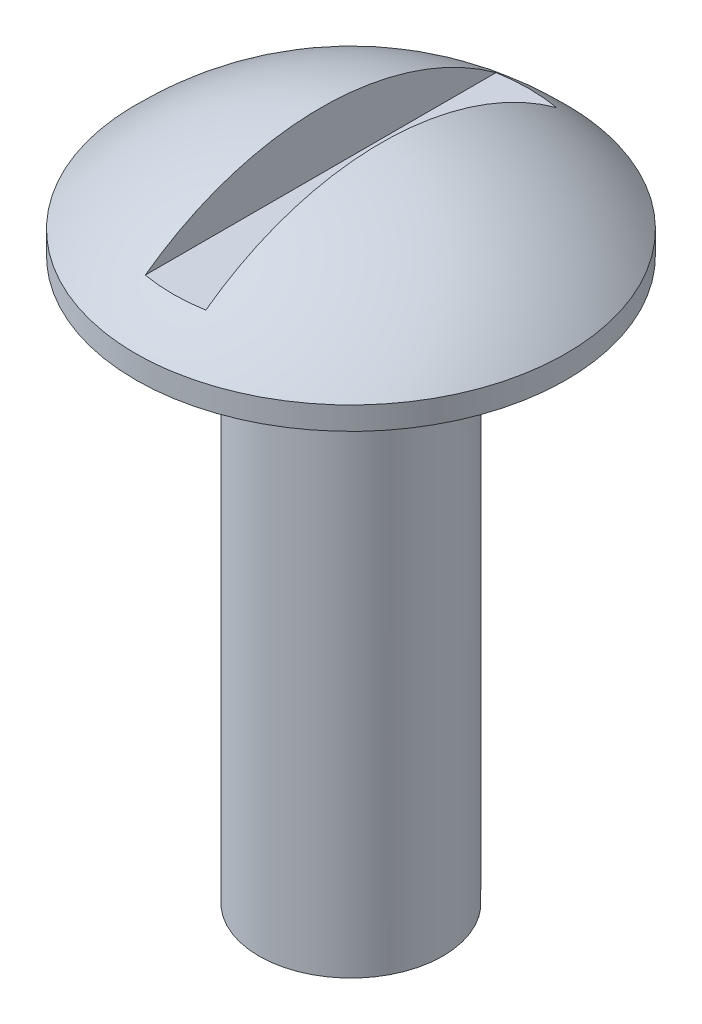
ISO-10303-21;
HEADER;
FILE_DESCRIPTION(('STEP AP214'),'2;1');
FILE_NAME('part.step','',(''),(''),'','','');
FILE_SCHEMA(('AUTOMOTIVE_DESIGN { 1 0 10303 214 1 1 1 1 }'));
ENDSEC;
DATA;
#1=APPLICATION_CONTEXT('core data for automotive mechanical design processes');
#2=APPLICATION_PROTOCOL_DEFINITION('international standard','automotive_design',2000,#1);
#3=PRODUCT_CONTEXT('',#1,'mechanical');
#4=PRODUCT('Part','Part','',(#3));
#5=PRODUCT_RELATED_PRODUCT_CATEGORY('part','',(#4));
#6=PRODUCT_DEFINITION_FORMATION('','',#4);
#7=PRODUCT_DEFINITION_CONTEXT('part definition',#1,'design');
#8=PRODUCT_DEFINITION('design','',#6,#7);
#9=PRODUCT_DEFINITION_SHAPE('','',#8);
#10=(LENGTH_UNIT() NAMED_UNIT(*) SI_UNIT(.MILLI.,.METRE.));
#11=(NAMED_UNIT(*) PLANE_ANGLE_UNIT() SI_UNIT($,.RADIAN.));
#12=(NAMED_UNIT(*) SI_UNIT($,.STERADIAN.) SOLID_ANGLE_UNIT());
#13=UNCERTAINTY_MEASURE_WITH_UNIT(LENGTH_MEASURE(1.E-05),#10,'distance_accuracy_value','');
#14=(GEOMETRIC_REPRESENTATION_CONTEXT(3) GLOBAL_UNCERTAINTY_ASSIGNED_CONTEXT((#13)) GLOBAL_UNIT_ASSIGNED_CONTEXT((#10,
#11,#12)) REPRESENTATION_CONTEXT('',''));
#15=CARTESIAN_POINT('',(0.,0.,0.));
#16=DIRECTION('',(0.,0.,1.));
#17=DIRECTION('',(1.,0.,0.));
#18=AXIS2_PLACEMENT_3D('',#15,#16,#17);
#19=CARTESIAN_POINT('',(0.,-4.18293176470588,0.));
#20=DIRECTION('',(0.,0.,1.));
#21=DIRECTION('',(1.,0.,0.));
#22=AXIS2_PLACEMENT_3D('',#19,#20,#21);
#23=SPHERICAL_SURFACE('',#22,6.77373176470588);
#24=CARTESIAN_POINT('',(0.,0.51816,0.));
#25=DIRECTION('',(0.,1.,0.));
#26=DIRECTION('',(0.,0.,1.));
#27=AXIS2_PLACEMENT_3D('',#24,#25,#26);
#28=CIRCLE('',#27,4.8768);
#29=CARTESIAN_POINT('',(0.,0.51816,4.8768));
#30=VERTEX_POINT('',#29);
#31=EDGE_CURVE('E90',#30,#30,#28,.T.);
#32=ORIENTED_EDGE('',*,*,#31,.T.);
#33=EDGE_LOOP('',(#32));
#34=FACE_BOUND('',#33,.T.);
#35=CARTESIAN_POINT('',(0.6858,-4.18293176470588,0.));
#36=DIRECTION('',(1.,0.,0.));
#37=DIRECTION('',(0.,1.,0.));
#38=AXIS2_PLACEMENT_3D('',#35,#36,#37);
#39=CIRCLE('',#38,6.73892575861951);
#40=CARTESIAN_POINT('',(0.6858,1.26059399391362,3.97254926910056));
#41=VERTEX_POINT('',#40);
#42=CARTESIAN_POINT('',(0.6858,1.26059399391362,-3.97254926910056));
#43=VERTEX_POINT('',#42);
#44=EDGE_CURVE('E65',#41,#43,#39,.F.);
#45=ORIENTED_EDGE('',*,*,#44,.F.);
#46=CARTESIAN_POINT('',(0.,1.26059399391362,0.));
#47=DIRECTION('',(0.,1.,0.));
#48=DIRECTION('',(0.,0.,1.));
#49=AXIS2_PLACEMENT_3D('',#46,#47,#48);
#50=CIRCLE('',#49,4.03131111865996);
#51=CARTESIAN_POINT('',(-0.6858,1.26059399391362,3.97254926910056));
#52=VERTEX_POINT('',#51);
#53=EDGE_CURVE('E73',#41,#52,#50,.F.);
#54=ORIENTED_EDGE('',*,*,#53,.T.);
#55=CARTESIAN_POINT('',(-0.685799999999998,-4.18293176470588,0.));
#56=DIRECTION('',(-1.,0.,0.));
#57=DIRECTION('',(0.,-1.,0.));
#58=AXIS2_PLACEMENT_3D('',#55,#56,#57);
#59=CIRCLE('',#58,6.73892575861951);
#60=CARTESIAN_POINT('',(-0.6858,1.26059399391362,-3.97254926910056));
#61=VERTEX_POINT('',#60);
#62=EDGE_CURVE('E11',#61,#52,#59,.F.);
#63=ORIENTED_EDGE('',*,*,#62,.F.);
#64=CARTESIAN_POINT('',(0.,1.26059399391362,0.));
#65=DIRECTION('',(0.,-1.,0.));
#66=DIRECTION('',(0.,0.,-1.));
#67=AXIS2_PLACEMENT_3D('',#64,#65,#66);
#68=CIRCLE('',#67,4.03131111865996);
#69=EDGE_CURVE('E49',#43,#61,#68,.F.);
#70=ORIENTED_EDGE('',*,*,#69,.F.);
#71=EDGE_LOOP('',(#45,#54,#63,#70));
#72=FACE_BOUND('',#71,.T.);
#73=ADVANCED_FACE('F43',(#34,#72),#23,.T.);
#74=CARTESIAN_POINT('',(0.,0.51816,0.));
#75=DIRECTION('',(0.,-1.,0.));
#76=DIRECTION('',(0.,0.,-1.));
#77=AXIS2_PLACEMENT_3D('',#74,#75,#76);
#78=CYLINDRICAL_SURFACE('',#77,4.8768);
#79=ORIENTED_EDGE('',*,*,#31,.F.);
#80=EDGE_LOOP('',(#79));
#81=FACE_BOUND('',#80,.T.);
#82=CARTESIAN_POINT('',(0.,0.,0.));
#83=DIRECTION('',(0.,1.,0.));
#84=DIRECTION('',(0.,0.,1.));
#85=AXIS2_PLACEMENT_3D('',#82,#83,#84);
#86=CIRCLE('',#85,4.8768);
#87=CARTESIAN_POINT('',(0.,0.,4.8768));
#88=VERTEX_POINT('',#87);
#89=EDGE_CURVE('E83',#88,#88,#86,.T.);
#90=ORIENTED_EDGE('',*,*,#89,.T.);
#91=EDGE_LOOP('',(#90));
#92=FACE_BOUND('',#91,.T.);
#93=ADVANCED_FACE('F99',(#81,#92),#78,.T.);
#94=CARTESIAN_POINT('',(0.,0.,0.));
#95=DIRECTION('',(0.,1.,0.));
#96=DIRECTION('',(0.,0.,1.));
#97=AXIS2_PLACEMENT_3D('',#94,#95,#96);
#98=PLANE('',#97);
#99=CARTESIAN_POINT('',(0.,0.,0.));
#100=DIRECTION('',(0.,1.,0.));
#101=DIRECTION('',(0.,0.,1.));
#102=AXIS2_PLACEMENT_3D('',#99,#100,#101);
#103=CIRCLE('',#102,2.0828);
#104=CARTESIAN_POINT('',(0.,0.,2.0828));
#105=VERTEX_POINT('',#104);
#106=EDGE_CURVE('E88',#105,#105,#103,.F.);
#107=ORIENTED_EDGE('',*,*,#106,.F.);
#108=EDGE_LOOP('',(#107));
#109=FACE_BOUND('',#108,.T.);
#110=ORIENTED_EDGE('',*,*,#89,.F.);
#111=EDGE_LOOP('',(#110));
#112=FACE_BOUND('',#111,.T.);
#113=ADVANCED_FACE('F97',(#109,#112),#98,.F.);
#114=CARTESIAN_POINT('',(0.,-12.7,0.));
#115=DIRECTION('',(0.,1.,0.));
#116=DIRECTION('',(0.,0.,1.));
#117=AXIS2_PLACEMENT_3D('',#114,#115,#116);
#118=CYLINDRICAL_SURFACE('',#117,2.0828);
#119=CARTESIAN_POINT('',(0.,-12.7,0.));
#120=DIRECTION('',(0.,-1.,0.));
#121=DIRECTION('',(0.,0.,-1.));
#122=AXIS2_PLACEMENT_3D('',#119,#120,#121);
#123=CIRCLE('',#122,2.0828);
#124=CARTESIAN_POINT('',(0.,-12.7,-2.0828));
#125=VERTEX_POINT('',#124);
#126=EDGE_CURVE('E77',#125,#125,#123,.T.);
#127=ORIENTED_EDGE('',*,*,#126,.F.);
#128=EDGE_LOOP('',(#127));
#129=FACE_BOUND('',#128,.T.);
#130=ORIENTED_EDGE('',*,*,#106,.T.);
#131=EDGE_LOOP('',(#130));
#132=FACE_BOUND('',#131,.T.);
#133=ADVANCED_FACE('F93',(#129,#132),#118,.T.);
#134=CARTESIAN_POINT('',(0.,-12.7,0.));
#135=DIRECTION('',(0.,-1.,0.));
#136=DIRECTION('',(0.,0.,-1.));
#137=AXIS2_PLACEMENT_3D('',#134,#135,#136);
#138=PLANE('',#137);
#139=ORIENTED_EDGE('',*,*,#126,.T.);
#140=EDGE_LOOP('',(#139));
#141=FACE_BOUND('',#140,.T.);
#142=ADVANCED_FACE('F112',(#141),#138,.T.);
#143=CARTESIAN_POINT('',(-0.6858,1.26059399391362,-4.8768));
#144=DIRECTION('',(0.,-1.,0.));
#145=DIRECTION('',(0.,0.,-1.));
#146=AXIS2_PLACEMENT_3D('',#143,#144,#145);
#147=PLANE('',#146);
#148=ORIENTED_EDGE('',*,*,#69,.T.);
#149=DIRECTION('',(0.,0.,1.));
#150=VECTOR('',#149,1.);
#151=CARTESIAN_POINT('',(-0.6858,1.26059399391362,-4.8768));
#152=LINE('',#151,#150);
#153=EDGE_CURVE('E68',#61,#52,#152,.T.);
#154=ORIENTED_EDGE('',*,*,#153,.T.);
#155=ORIENTED_EDGE('',*,*,#53,.F.);
#156=DIRECTION('',(0.,0.,1.));
#157=VECTOR('',#156,1.);
#158=CARTESIAN_POINT('',(0.6858,1.26059399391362,-4.8768));
#159=LINE('',#158,#157);
#160=EDGE_CURVE('E80',#43,#41,#159,.T.);
#161=ORIENTED_EDGE('',*,*,#160,.F.);
#162=EDGE_LOOP('',(#148,#154,#155,#161));
#163=FACE_BOUND('',#162,.T.);
#164=ADVANCED_FACE('F71',(#163),#147,.F.);
#165=CARTESIAN_POINT('',(-0.685800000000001,2.55599399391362,-4.8768));
#166=DIRECTION('',(-1.,0.,0.));
#167=DIRECTION('',(0.,-1.,0.));
#168=AXIS2_PLACEMENT_3D('',#165,#166,#167);
#169=PLANE('',#168);
#170=ORIENTED_EDGE('',*,*,#62,.T.);
#171=ORIENTED_EDGE('',*,*,#153,.F.);
#172=EDGE_LOOP('',(#170,#171));
#173=FACE_BOUND('',#172,.T.);
#174=ADVANCED_FACE('F66',(#173),#169,.F.);
#175=CARTESIAN_POINT('',(0.6858,2.55599399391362,-4.8768));
#176=DIRECTION('',(1.,0.,0.));
#177=DIRECTION('',(0.,1.,0.));
#178=AXIS2_PLACEMENT_3D('',#175,#176,#177);
#179=PLANE('',#178);
#180=ORIENTED_EDGE('',*,*,#44,.T.);
#181=ORIENTED_EDGE('',*,*,#160,.T.);
#182=EDGE_LOOP('',(#180,#181));
#183=FACE_BOUND('',#182,.T.);
#184=ADVANCED_FACE('F122',(#183),#179,.F.);
#185=CLOSED_SHELL('',(#73,#93,#113,#133,#142,#164,#174,#184));
#186=MANIFOLD_SOLID_BREP('B2',#185);
#187=ADVANCED_BREP_SHAPE_REPRESENTATION('',(#18,#186),#14);
#188=SHAPE_DEFINITION_REPRESENTATION(#9,#187);
ENDSEC;
END-ISO-10303-21;
